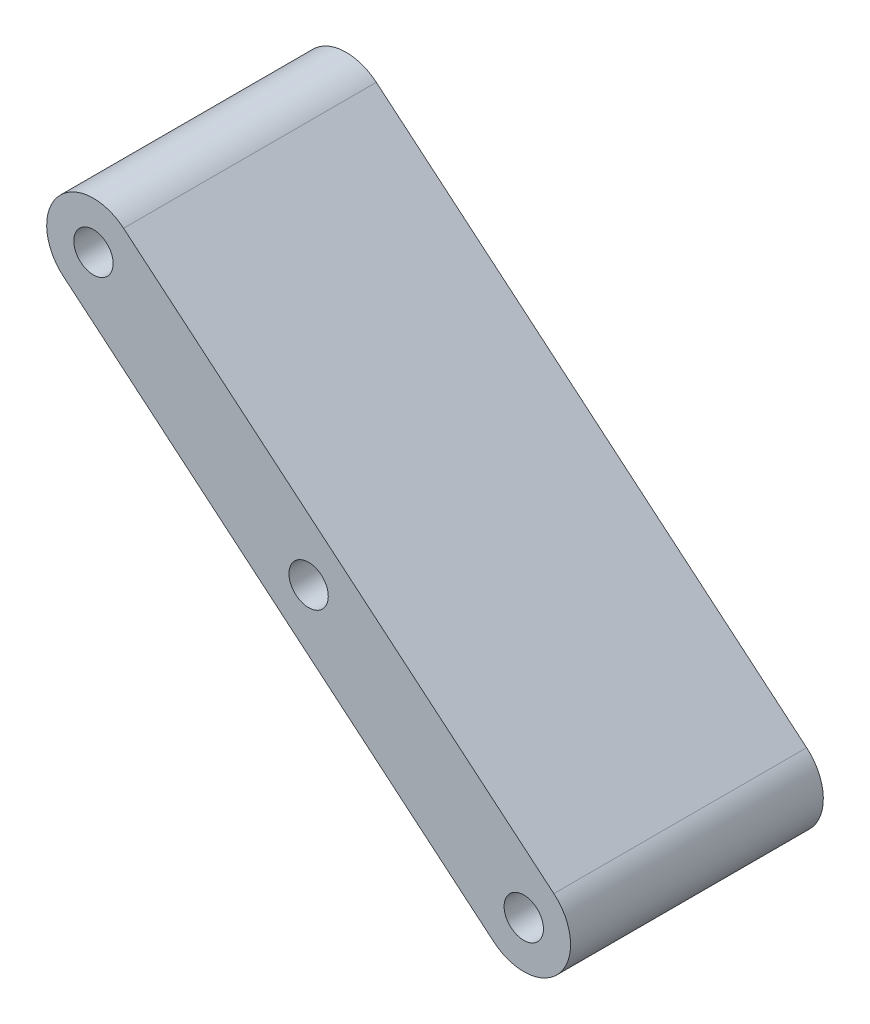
ISO-10303-21;
HEADER;
FILE_DESCRIPTION(('STEP AP214'),'2;1');
FILE_NAME('part.step','',(''),(''),'','','');
FILE_SCHEMA(('AUTOMOTIVE_DESIGN { 1 0 10303 214 1 1 1 1 }'));
ENDSEC;
DATA;
#1=APPLICATION_CONTEXT('core data for automotive mechanical design processes');
#2=APPLICATION_PROTOCOL_DEFINITION('international standard','automotive_design',2000,#1);
#3=PRODUCT_CONTEXT('',#1,'mechanical');
#4=PRODUCT('Part','Part','',(#3));
#5=PRODUCT_RELATED_PRODUCT_CATEGORY('part','',(#4));
#6=PRODUCT_DEFINITION_FORMATION('','',#4);
#7=PRODUCT_DEFINITION_CONTEXT('part definition',#1,'design');
#8=PRODUCT_DEFINITION('design','',#6,#7);
#9=PRODUCT_DEFINITION_SHAPE('','',#8);
#10=(LENGTH_UNIT() NAMED_UNIT(*) SI_UNIT(.MILLI.,.METRE.));
#11=(NAMED_UNIT(*) PLANE_ANGLE_UNIT() SI_UNIT($,.RADIAN.));
#12=(NAMED_UNIT(*) SI_UNIT($,.STERADIAN.) SOLID_ANGLE_UNIT());
#13=UNCERTAINTY_MEASURE_WITH_UNIT(LENGTH_MEASURE(1.E-05),#10,'distance_accuracy_value','');
#14=(GEOMETRIC_REPRESENTATION_CONTEXT(3) GLOBAL_UNCERTAINTY_ASSIGNED_CONTEXT((#13)) GLOBAL_UNIT_ASSIGNED_CONTEXT((#10,
#11,#12)) REPRESENTATION_CONTEXT('',''));
#15=CARTESIAN_POINT('',(0.,0.,0.));
#16=DIRECTION('',(0.,0.,1.));
#17=DIRECTION('',(1.,0.,0.));
#18=AXIS2_PLACEMENT_3D('',#15,#16,#17);
#19=CARTESIAN_POINT('',(47.8777776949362,-40.1742256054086,37.));
#20=DIRECTION('',(0.,0.,1.));
#21=DIRECTION('',(1.,0.,0.));
#22=AXIS2_PLACEMENT_3D('',#19,#20,#21);
#23=PLANE('',#22);
#24=CARTESIAN_POINT('',(70.8591109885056,-59.4578538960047,37.));
#25=DIRECTION('',(0.,0.,1.));
#26=DIRECTION('',(1.,0.,0.));
#27=AXIS2_PLACEMENT_3D('',#24,#25,#26);
#28=CIRCLE('',#27,2.1);
#29=CARTESIAN_POINT('',(72.9591109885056,-59.4578538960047,37.));
#30=VERTEX_POINT('',#29);
#31=EDGE_CURVE('E121',#30,#30,#28,.T.);
#32=ORIENTED_EDGE('',*,*,#31,.F.);
#33=EDGE_LOOP('',(#32));
#34=FACE_BOUND('',#33,.T.);
#35=CARTESIAN_POINT('',(47.8777776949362,-40.1742256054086,37.));
#36=DIRECTION('',(0.,0.,1.));
#37=DIRECTION('',(1.,0.,0.));
#38=AXIS2_PLACEMENT_3D('',#35,#36,#37);
#39=CIRCLE('',#38,5.);
#40=CARTESIAN_POINT('',(51.0917157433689,-36.3440033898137,37.));
#41=VERTEX_POINT('',#40);
#42=CARTESIAN_POINT('',(44.6638396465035,-44.0044478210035,37.));
#43=VERTEX_POINT('',#42);
#44=EDGE_CURVE('E91',#41,#43,#39,.T.);
#45=ORIENTED_EDGE('',*,*,#44,.T.);
#46=DIRECTION('',(0.766044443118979,-0.642787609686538,0.));
#47=VECTOR('',#46,1.);
#48=CARTESIAN_POINT('',(44.6638396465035,-44.0044478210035,37.));
#49=LINE('',#48,#47);
#50=CARTESIAN_POINT('',(90.6265062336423,-82.5717044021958,37.));
#51=VERTEX_POINT('',#50);
#52=EDGE_CURVE('E86',#43,#51,#49,.T.);
#53=ORIENTED_EDGE('',*,*,#52,.T.);
#54=CARTESIAN_POINT('',(93.840444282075,-78.7414821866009,37.));
#55=DIRECTION('',(0.,0.,1.));
#56=DIRECTION('',(1.,0.,0.));
#57=AXIS2_PLACEMENT_3D('',#54,#55,#56);
#58=CIRCLE('',#57,5.);
#59=CARTESIAN_POINT('',(97.0543823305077,-74.911259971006,37.));
#60=VERTEX_POINT('',#59);
#61=EDGE_CURVE('E89',#51,#60,#58,.T.);
#62=ORIENTED_EDGE('',*,*,#61,.T.);
#63=DIRECTION('',(-0.766044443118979,0.642787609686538,0.));
#64=VECTOR('',#63,1.);
#65=CARTESIAN_POINT('',(51.0917157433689,-36.3440033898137,37.));
#66=LINE('',#65,#64);
#67=EDGE_CURVE('E56',#60,#41,#66,.T.);
#68=ORIENTED_EDGE('',*,*,#67,.T.);
#69=EDGE_LOOP('',(#45,#53,#62,#68));
#70=FACE_BOUND('',#69,.T.);
#71=CARTESIAN_POINT('',(47.8777776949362,-40.1742256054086,37.));
#72=DIRECTION('',(0.,0.,1.));
#73=DIRECTION('',(1.,0.,0.));
#74=AXIS2_PLACEMENT_3D('',#71,#72,#73);
#75=CIRCLE('',#74,2.1);
#76=CARTESIAN_POINT('',(49.9777776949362,-40.1742256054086,37.));
#77=VERTEX_POINT('',#76);
#78=EDGE_CURVE('E106',#77,#77,#75,.T.);
#79=ORIENTED_EDGE('',*,*,#78,.F.);
#80=EDGE_LOOP('',(#79));
#81=FACE_BOUND('',#80,.T.);
#82=CARTESIAN_POINT('',(93.840444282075,-78.7414821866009,37.));
#83=DIRECTION('',(0.,0.,1.));
#84=DIRECTION('',(1.,0.,0.));
#85=AXIS2_PLACEMENT_3D('',#82,#83,#84);
#86=CIRCLE('',#85,2.1);
#87=CARTESIAN_POINT('',(95.940444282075,-78.7414821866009,37.));
#88=VERTEX_POINT('',#87);
#89=EDGE_CURVE('E127',#88,#88,#86,.T.);
#90=ORIENTED_EDGE('',*,*,#89,.F.);
#91=EDGE_LOOP('',(#90));
#92=FACE_BOUND('',#91,.T.);
#93=ADVANCED_FACE('F39',(#34,#70,#81,#92),#23,.T.);
#94=CARTESIAN_POINT('',(47.8777776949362,-40.1742256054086,10.));
#95=DIRECTION('',(0.,0.,1.));
#96=DIRECTION('',(1.,0.,0.));
#97=AXIS2_PLACEMENT_3D('',#94,#95,#96);
#98=PLANE('',#97);
#99=CARTESIAN_POINT('',(47.8777776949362,-40.1742256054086,10.));
#100=DIRECTION('',(0.,0.,1.));
#101=DIRECTION('',(1.,0.,0.));
#102=AXIS2_PLACEMENT_3D('',#99,#100,#101);
#103=CIRCLE('',#102,5.);
#104=CARTESIAN_POINT('',(51.0917157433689,-36.3440033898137,10.));
#105=VERTEX_POINT('',#104);
#106=CARTESIAN_POINT('',(44.6638396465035,-44.0044478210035,10.));
#107=VERTEX_POINT('',#106);
#108=EDGE_CURVE('E103',#105,#107,#103,.T.);
#109=ORIENTED_EDGE('',*,*,#108,.F.);
#110=DIRECTION('',(-0.766044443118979,0.642787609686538,0.));
#111=VECTOR('',#110,1.);
#112=CARTESIAN_POINT('',(51.0917157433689,-36.3440033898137,10.));
#113=LINE('',#112,#111);
#114=CARTESIAN_POINT('',(97.0543823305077,-74.911259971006,10.));
#115=VERTEX_POINT('',#114);
#116=EDGE_CURVE('E79',#115,#105,#113,.T.);
#117=ORIENTED_EDGE('',*,*,#116,.F.);
#118=CARTESIAN_POINT('',(93.840444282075,-78.7414821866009,10.));
#119=DIRECTION('',(0.,0.,1.));
#120=DIRECTION('',(1.,0.,0.));
#121=AXIS2_PLACEMENT_3D('',#118,#119,#120);
#122=CIRCLE('',#121,5.);
#123=CARTESIAN_POINT('',(90.6265062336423,-82.5717044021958,10.));
#124=VERTEX_POINT('',#123);
#125=EDGE_CURVE('E73',#124,#115,#122,.T.);
#126=ORIENTED_EDGE('',*,*,#125,.F.);
#127=DIRECTION('',(0.766044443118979,-0.642787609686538,0.));
#128=VECTOR('',#127,1.);
#129=CARTESIAN_POINT('',(44.6638396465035,-44.0044478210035,10.));
#130=LINE('',#129,#128);
#131=EDGE_CURVE('E95',#107,#124,#130,.T.);
#132=ORIENTED_EDGE('',*,*,#131,.F.);
#133=EDGE_LOOP('',(#109,#117,#126,#132));
#134=FACE_BOUND('',#133,.T.);
#135=CARTESIAN_POINT('',(47.8777776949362,-40.1742256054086,10.));
#136=DIRECTION('',(0.,0.,1.));
#137=DIRECTION('',(1.,0.,0.));
#138=AXIS2_PLACEMENT_3D('',#135,#136,#137);
#139=CIRCLE('',#138,2.1);
#140=CARTESIAN_POINT('',(49.9777776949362,-40.1742256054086,10.));
#141=VERTEX_POINT('',#140);
#142=EDGE_CURVE('E118',#141,#141,#139,.T.);
#143=ORIENTED_EDGE('',*,*,#142,.T.);
#144=EDGE_LOOP('',(#143));
#145=FACE_BOUND('',#144,.T.);
#146=CARTESIAN_POINT('',(70.8591109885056,-59.4578538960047,10.));
#147=DIRECTION('',(0.,0.,1.));
#148=DIRECTION('',(1.,0.,0.));
#149=AXIS2_PLACEMENT_3D('',#146,#147,#148);
#150=CIRCLE('',#149,2.1);
#151=CARTESIAN_POINT('',(72.9591109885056,-59.4578538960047,10.));
#152=VERTEX_POINT('',#151);
#153=EDGE_CURVE('E124',#152,#152,#150,.T.);
#154=ORIENTED_EDGE('',*,*,#153,.T.);
#155=EDGE_LOOP('',(#154));
#156=FACE_BOUND('',#155,.T.);
#157=CARTESIAN_POINT('',(93.840444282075,-78.7414821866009,10.));
#158=DIRECTION('',(0.,0.,1.));
#159=DIRECTION('',(1.,0.,0.));
#160=AXIS2_PLACEMENT_3D('',#157,#158,#159);
#161=CIRCLE('',#160,2.1);
#162=CARTESIAN_POINT('',(95.940444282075,-78.7414821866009,10.));
#163=VERTEX_POINT('',#162);
#164=EDGE_CURVE('E130',#163,#163,#161,.T.);
#165=ORIENTED_EDGE('',*,*,#164,.T.);
#166=EDGE_LOOP('',(#165));
#167=FACE_BOUND('',#166,.T.);
#168=ADVANCED_FACE('F114',(#134,#145,#156,#167),#98,.F.);
#169=CARTESIAN_POINT('',(47.8777776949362,-40.1742256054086,37.));
#170=DIRECTION('',(0.,0.,-1.));
#171=DIRECTION('',(-1.,0.,0.));
#172=AXIS2_PLACEMENT_3D('',#169,#170,#171);
#173=CYLINDRICAL_SURFACE('',#172,5.);
#174=ORIENTED_EDGE('',*,*,#108,.T.);
#175=DIRECTION('',(0.,0.,-1.));
#176=VECTOR('',#175,1.);
#177=CARTESIAN_POINT('',(44.6638396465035,-44.0044478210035,37.));
#178=LINE('',#177,#176);
#179=EDGE_CURVE('E11',#43,#107,#178,.T.);
#180=ORIENTED_EDGE('',*,*,#179,.F.);
#181=ORIENTED_EDGE('',*,*,#44,.F.);
#182=DIRECTION('',(0.,0.,-1.));
#183=VECTOR('',#182,1.);
#184=CARTESIAN_POINT('',(51.0917157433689,-36.3440033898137,37.));
#185=LINE('',#184,#183);
#186=EDGE_CURVE('E99',#41,#105,#185,.T.);
#187=ORIENTED_EDGE('',*,*,#186,.T.);
#188=EDGE_LOOP('',(#174,#180,#181,#187));
#189=FACE_BOUND('',#188,.T.);
#190=ADVANCED_FACE('F41',(#189),#173,.T.);
#191=CARTESIAN_POINT('',(44.6638396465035,-44.0044478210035,37.));
#192=DIRECTION('',(0.642787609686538,0.766044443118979,0.));
#193=DIRECTION('',(-0.766044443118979,0.642787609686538,0.));
#194=AXIS2_PLACEMENT_3D('',#191,#192,#193);
#195=PLANE('',#194);
#196=ORIENTED_EDGE('',*,*,#131,.T.);
#197=DIRECTION('',(0.,0.,-1.));
#198=VECTOR('',#197,1.);
#199=CARTESIAN_POINT('',(90.6265062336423,-82.5717044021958,37.));
#200=LINE('',#199,#198);
#201=EDGE_CURVE('E48',#51,#124,#200,.T.);
#202=ORIENTED_EDGE('',*,*,#201,.F.);
#203=ORIENTED_EDGE('',*,*,#52,.F.);
#204=ORIENTED_EDGE('',*,*,#179,.T.);
#205=EDGE_LOOP('',(#196,#202,#203,#204));
#206=FACE_BOUND('',#205,.T.);
#207=ADVANCED_FACE('F94',(#206),#195,.F.);
#208=CARTESIAN_POINT('',(93.840444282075,-78.7414821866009,37.));
#209=DIRECTION('',(0.,0.,-1.));
#210=DIRECTION('',(-1.,0.,0.));
#211=AXIS2_PLACEMENT_3D('',#208,#209,#210);
#212=CYLINDRICAL_SURFACE('',#211,5.);
#213=ORIENTED_EDGE('',*,*,#125,.T.);
#214=DIRECTION('',(0.,0.,-1.));
#215=VECTOR('',#214,1.);
#216=CARTESIAN_POINT('',(97.0543823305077,-74.911259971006,37.));
#217=LINE('',#216,#215);
#218=EDGE_CURVE('E96',#60,#115,#217,.T.);
#219=ORIENTED_EDGE('',*,*,#218,.F.);
#220=ORIENTED_EDGE('',*,*,#61,.F.);
#221=ORIENTED_EDGE('',*,*,#201,.T.);
#222=EDGE_LOOP('',(#213,#219,#220,#221));
#223=FACE_BOUND('',#222,.T.);
#224=ADVANCED_FACE('F97',(#223),#212,.T.);
#225=CARTESIAN_POINT('',(51.0917157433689,-36.3440033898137,37.));
#226=DIRECTION('',(-0.642787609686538,-0.766044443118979,0.));
#227=DIRECTION('',(0.766044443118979,-0.642787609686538,0.));
#228=AXIS2_PLACEMENT_3D('',#225,#226,#227);
#229=PLANE('',#228);
#230=ORIENTED_EDGE('',*,*,#116,.T.);
#231=ORIENTED_EDGE('',*,*,#186,.F.);
#232=ORIENTED_EDGE('',*,*,#67,.F.);
#233=ORIENTED_EDGE('',*,*,#218,.T.);
#234=EDGE_LOOP('',(#230,#231,#232,#233));
#235=FACE_BOUND('',#234,.T.);
#236=ADVANCED_FACE('F111',(#235),#229,.F.);
#237=CARTESIAN_POINT('',(47.8777776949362,-40.1742256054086,37.));
#238=DIRECTION('',(0.,0.,-1.));
#239=DIRECTION('',(-1.,0.,0.));
#240=AXIS2_PLACEMENT_3D('',#237,#238,#239);
#241=CYLINDRICAL_SURFACE('',#240,2.1);
#242=ORIENTED_EDGE('',*,*,#78,.T.);
#243=EDGE_LOOP('',(#242));
#244=FACE_BOUND('',#243,.T.);
#245=ORIENTED_EDGE('',*,*,#142,.F.);
#246=EDGE_LOOP('',(#245));
#247=FACE_BOUND('',#246,.T.);
#248=ADVANCED_FACE('F148',(#244,#247),#241,.F.);
#249=CARTESIAN_POINT('',(70.8591109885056,-59.4578538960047,37.));
#250=DIRECTION('',(0.,0.,-1.));
#251=DIRECTION('',(-1.,0.,0.));
#252=AXIS2_PLACEMENT_3D('',#249,#250,#251);
#253=CYLINDRICAL_SURFACE('',#252,2.1);
#254=ORIENTED_EDGE('',*,*,#31,.T.);
#255=EDGE_LOOP('',(#254));
#256=FACE_BOUND('',#255,.T.);
#257=ORIENTED_EDGE('',*,*,#153,.F.);
#258=EDGE_LOOP('',(#257));
#259=FACE_BOUND('',#258,.T.);
#260=ADVANCED_FACE('F193',(#256,#259),#253,.F.);
#261=CARTESIAN_POINT('',(93.840444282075,-78.7414821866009,37.));
#262=DIRECTION('',(0.,0.,-1.));
#263=DIRECTION('',(-1.,0.,0.));
#264=AXIS2_PLACEMENT_3D('',#261,#262,#263);
#265=CYLINDRICAL_SURFACE('',#264,2.1);
#266=ORIENTED_EDGE('',*,*,#89,.T.);
#267=EDGE_LOOP('',(#266));
#268=FACE_BOUND('',#267,.T.);
#269=ORIENTED_EDGE('',*,*,#164,.F.);
#270=EDGE_LOOP('',(#269));
#271=FACE_BOUND('',#270,.T.);
#272=ADVANCED_FACE('F136',(#268,#271),#265,.F.);
#273=CLOSED_SHELL('',(#93,#168,#190,#207,#224,#236,#248,#260,#272));
#274=MANIFOLD_SOLID_BREP('B2',#273);
#275=ADVANCED_BREP_SHAPE_REPRESENTATION('',(#18,#274),#14);
#276=SHAPE_DEFINITION_REPRESENTATION(#9,#275);
ENDSEC;
END-ISO-10303-21;
